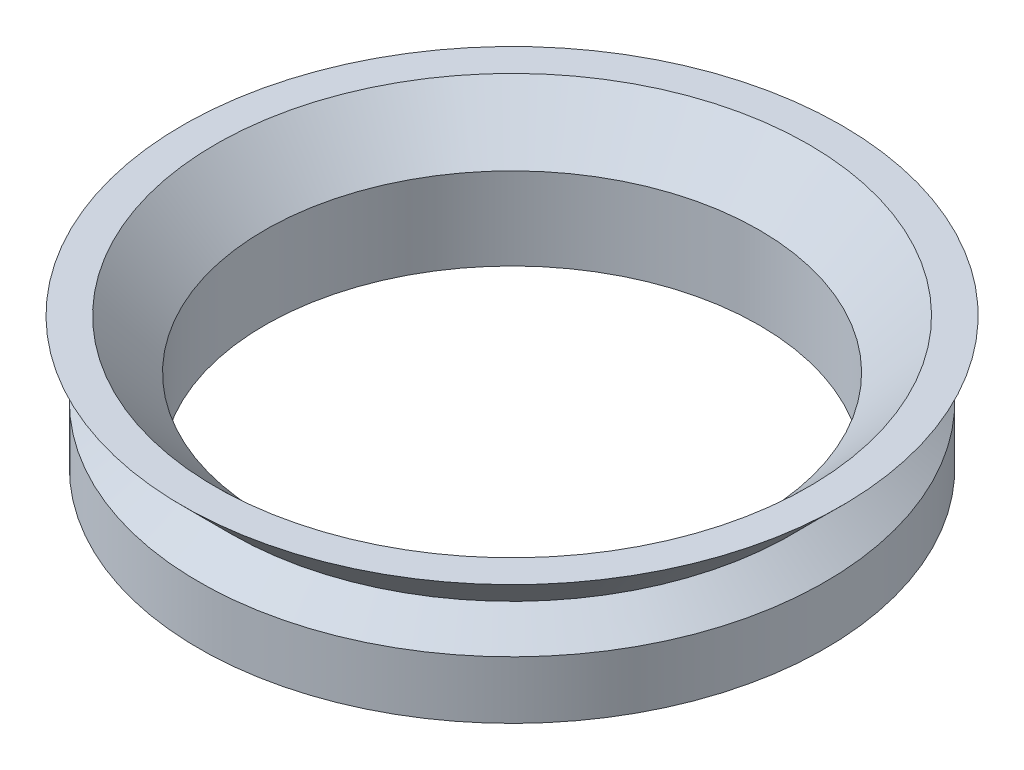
from build123d import *


with BuildPart() as part:
    # Esquisse1 → R_volution1 (revolve)
    with BuildSketch(Plane.XY, mode=Mode.PRIVATE) as r_volution1_sk:
        Polygon((15, 5), (15, 0), (19, 0), (19, 3.5), (17, 5), (20, 8), (18, 8), align=None)
    revolve(r_volution1_sk.sketch.rotate(Axis((0, -24.248861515, 0), (0, 1, 0)), 90), axis=Axis((0, -24.248861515, 0), (0, 1, 0)))


solid = part.part
